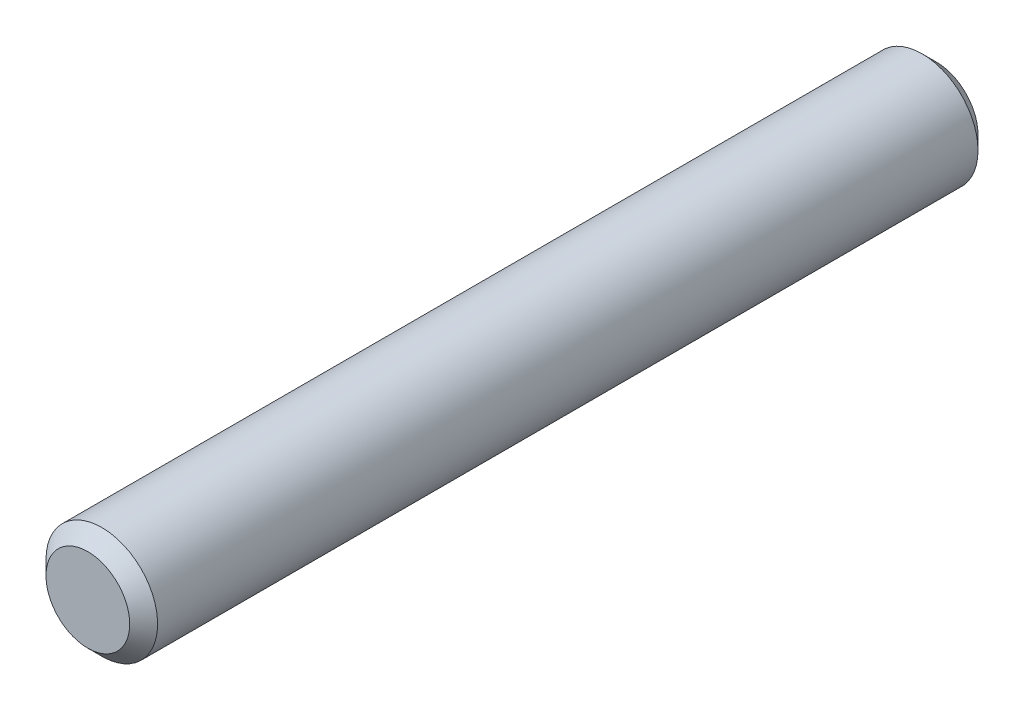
from build123d import *

# Parameters (mm, degrees)
ESQUISSE1_R          = 2
BASE_EXTRUSION_DEPTH = 30.4
CHANFREIN2_SIZE      = 0.5


with BuildPart() as part:
    # Esquisse1 → Base-Extrusion (new body)
    with BuildSketch(Plane.XY):
        with Locations(Location((-11.368861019, 14.538020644, 0), (0, 0, 180))):
            Circle(ESQUISSE1_R)
    extrude(amount=BASE_EXTRUSION_DEPTH)

    # Chanfrein2
    chanfrein2_edges = [part.edges().sort_by_distance(p)[0] for p in [
        (-9.368861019, 14.538020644, 0),
        (-9.368861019, 14.538020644, 30.4),
    ]]
    chamfer(chanfrein2_edges, length=CHANFREIN2_SIZE)


solid = part.part
